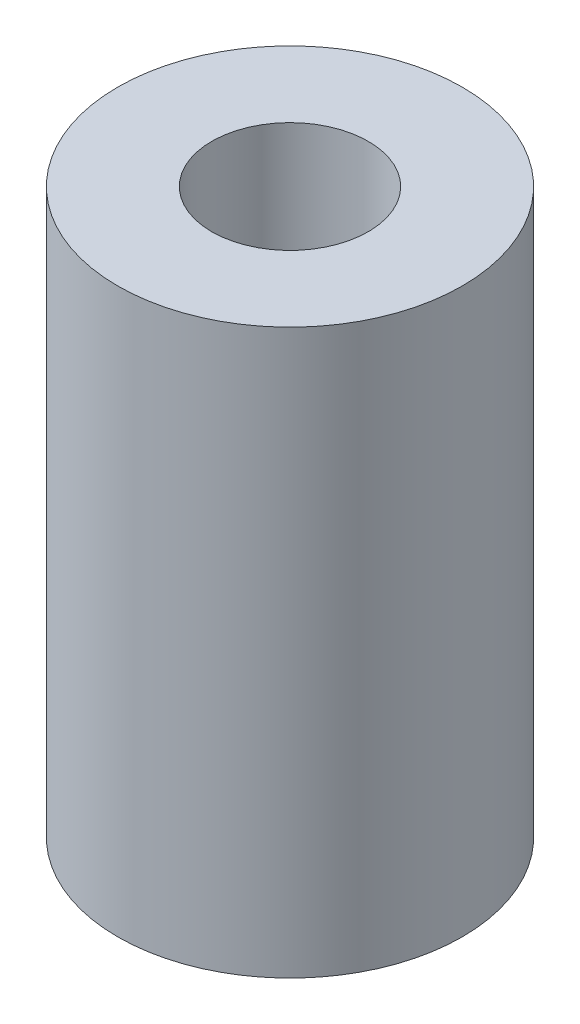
ISO-10303-21;
HEADER;
FILE_DESCRIPTION(('STEP AP214'),'2;1');
FILE_NAME('part.step','',(''),(''),'','','');
FILE_SCHEMA(('AUTOMOTIVE_DESIGN { 1 0 10303 214 1 1 1 1 }'));
ENDSEC;
DATA;
#1=APPLICATION_CONTEXT('core data for automotive mechanical design processes');
#2=APPLICATION_PROTOCOL_DEFINITION('international standard','automotive_design',2000,#1);
#3=PRODUCT_CONTEXT('',#1,'mechanical');
#4=PRODUCT('Part','Part','',(#3));
#5=PRODUCT_RELATED_PRODUCT_CATEGORY('part','',(#4));
#6=PRODUCT_DEFINITION_FORMATION('','',#4);
#7=PRODUCT_DEFINITION_CONTEXT('part definition',#1,'design');
#8=PRODUCT_DEFINITION('design','',#6,#7);
#9=PRODUCT_DEFINITION_SHAPE('','',#8);
#10=(LENGTH_UNIT() NAMED_UNIT(*) SI_UNIT(.MILLI.,.METRE.));
#11=(NAMED_UNIT(*) PLANE_ANGLE_UNIT() SI_UNIT($,.RADIAN.));
#12=(NAMED_UNIT(*) SI_UNIT($,.STERADIAN.) SOLID_ANGLE_UNIT());
#13=UNCERTAINTY_MEASURE_WITH_UNIT(LENGTH_MEASURE(1.E-05),#10,'distance_accuracy_value','');
#14=(GEOMETRIC_REPRESENTATION_CONTEXT(3) GLOBAL_UNCERTAINTY_ASSIGNED_CONTEXT((#13)) GLOBAL_UNIT_ASSIGNED_CONTEXT((#10,
#11,#12)) REPRESENTATION_CONTEXT('',''));
#15=CARTESIAN_POINT('',(0.,0.,0.));
#16=DIRECTION('',(0.,0.,1.));
#17=DIRECTION('',(1.,0.,0.));
#18=AXIS2_PLACEMENT_3D('',#15,#16,#17);
#19=CARTESIAN_POINT('',(0.,18.,0.));
#20=DIRECTION('',(0.,1.,0.));
#21=DIRECTION('',(0.,0.,1.));
#22=AXIS2_PLACEMENT_3D('',#19,#20,#21);
#23=PLANE('',#22);
#24=CARTESIAN_POINT('',(0.,18.,0.));
#25=DIRECTION('',(0.,1.,0.));
#26=DIRECTION('',(0.,0.,1.));
#27=AXIS2_PLACEMENT_3D('',#24,#25,#26);
#28=CIRCLE('',#27,5.5);
#29=CARTESIAN_POINT('',(0.,18.,5.5));
#30=VERTEX_POINT('',#29);
#31=EDGE_CURVE('E10',#30,#30,#28,.T.);
#32=ORIENTED_EDGE('',*,*,#31,.T.);
#33=EDGE_LOOP('',(#32));
#34=FACE_BOUND('',#33,.T.);
#35=CARTESIAN_POINT('',(0.,18.,0.));
#36=DIRECTION('',(0.,1.,0.));
#37=DIRECTION('',(0.,0.,1.));
#38=AXIS2_PLACEMENT_3D('',#35,#36,#37);
#39=CIRCLE('',#38,2.5);
#40=CARTESIAN_POINT('',(0.,18.,2.5));
#41=VERTEX_POINT('',#40);
#42=EDGE_CURVE('E41',#41,#41,#39,.T.);
#43=ORIENTED_EDGE('',*,*,#42,.F.);
#44=EDGE_LOOP('',(#43));
#45=FACE_BOUND('',#44,.T.);
#46=ADVANCED_FACE('F30',(#34,#45),#23,.T.);
#47=CARTESIAN_POINT('',(0.,0.,0.));
#48=DIRECTION('',(0.,1.,0.));
#49=DIRECTION('',(0.,0.,1.));
#50=AXIS2_PLACEMENT_3D('',#47,#48,#49);
#51=PLANE('',#50);
#52=CARTESIAN_POINT('',(0.,0.,0.));
#53=DIRECTION('',(0.,1.,0.));
#54=DIRECTION('',(0.,0.,1.));
#55=AXIS2_PLACEMENT_3D('',#52,#53,#54);
#56=CIRCLE('',#55,5.5);
#57=CARTESIAN_POINT('',(0.,0.,5.5));
#58=VERTEX_POINT('',#57);
#59=EDGE_CURVE('E34',#58,#58,#56,.T.);
#60=ORIENTED_EDGE('',*,*,#59,.F.);
#61=EDGE_LOOP('',(#60));
#62=FACE_BOUND('',#61,.T.);
#63=CARTESIAN_POINT('',(0.,0.,0.));
#64=DIRECTION('',(0.,1.,0.));
#65=DIRECTION('',(0.,0.,1.));
#66=AXIS2_PLACEMENT_3D('',#63,#64,#65);
#67=CIRCLE('',#66,2.5);
#68=CARTESIAN_POINT('',(0.,0.,2.5));
#69=VERTEX_POINT('',#68);
#70=EDGE_CURVE('E43',#69,#69,#67,.T.);
#71=ORIENTED_EDGE('',*,*,#70,.T.);
#72=EDGE_LOOP('',(#71));
#73=FACE_BOUND('',#72,.T.);
#74=ADVANCED_FACE('F53',(#62,#73),#51,.F.);
#75=CARTESIAN_POINT('',(0.,18.,0.));
#76=DIRECTION('',(0.,-1.,0.));
#77=DIRECTION('',(0.,0.,-1.));
#78=AXIS2_PLACEMENT_3D('',#75,#76,#77);
#79=CYLINDRICAL_SURFACE('',#78,5.5);
#80=ORIENTED_EDGE('',*,*,#31,.F.);
#81=EDGE_LOOP('',(#80));
#82=FACE_BOUND('',#81,.T.);
#83=ORIENTED_EDGE('',*,*,#59,.T.);
#84=EDGE_LOOP('',(#83));
#85=FACE_BOUND('',#84,.T.);
#86=ADVANCED_FACE('F32',(#82,#85),#79,.T.);
#87=CARTESIAN_POINT('',(0.,18.,0.));
#88=DIRECTION('',(0.,-1.,0.));
#89=DIRECTION('',(0.,0.,-1.));
#90=AXIS2_PLACEMENT_3D('',#87,#88,#89);
#91=CYLINDRICAL_SURFACE('',#90,2.5);
#92=ORIENTED_EDGE('',*,*,#42,.T.);
#93=EDGE_LOOP('',(#92));
#94=FACE_BOUND('',#93,.T.);
#95=ORIENTED_EDGE('',*,*,#70,.F.);
#96=EDGE_LOOP('',(#95));
#97=FACE_BOUND('',#96,.T.);
#98=ADVANCED_FACE('F49',(#94,#97),#91,.F.);
#99=CLOSED_SHELL('',(#46,#74,#86,#98));
#100=MANIFOLD_SOLID_BREP('B2',#99);
#101=ADVANCED_BREP_SHAPE_REPRESENTATION('',(#18,#100),#14);
#102=SHAPE_DEFINITION_REPRESENTATION(#9,#101);
ENDSEC;
END-ISO-10303-21;
